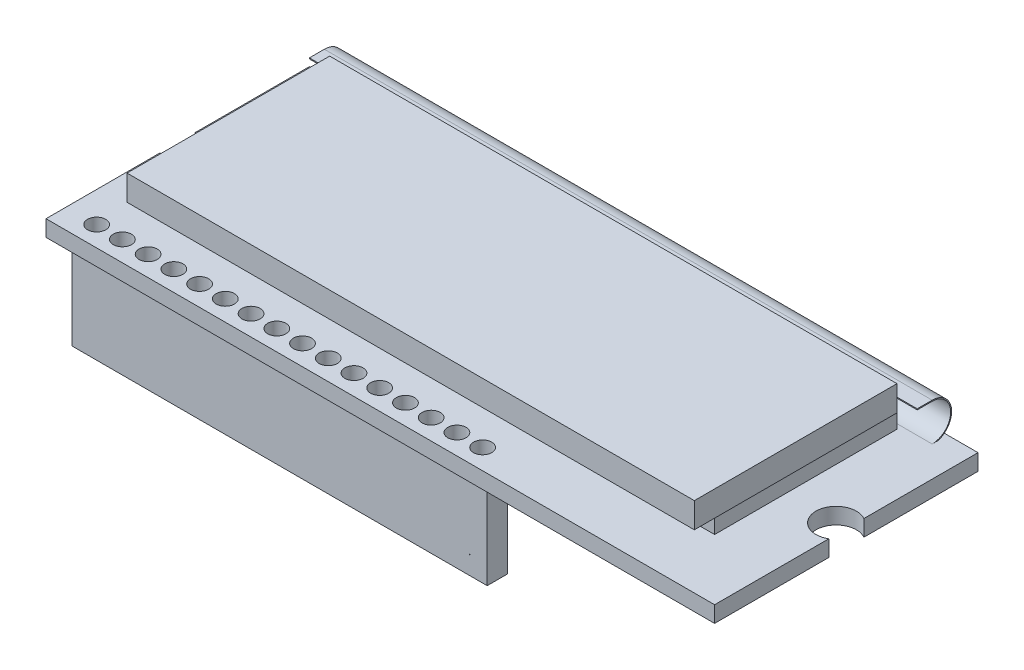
from build123d import *

# Parameters (mm, degrees)
SKETCH1_W                = 66
SKETCH1_H                = 26
BOSS_EXTRUDE1_DEPTH      = 1.6
SKETCH2_R                = 2
CUT_EXTRUDE1_DEPTH       = 36.504365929
SKETCH3_W                = 54
SKETCH3_H                = 18
BOSS_EXTRUDE2_DEPTH      = 2.4
SKETCH4_W                = 56
SKETCH4_H                = 20
BOSS_EXTRUDE3_DEPTH      = 2.5
EXTRUDE_THIN1_DEPTH      = 30
EXTRUDE_THIN1_DEPTH_BACK = 30
SKETCH6_R                = 0.9
CUT_EXTRUDE2_DEPTH       = 36.952329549
SKETCH7_W                = 41
SKETCH7_H                = 2
BOSS_EXTRUDE4_DEPTH      = 9
CUT_EXTRUDE3_START       = -9
SKETCH8_R                = 0.9
CUT_EXTRUDE3_DEPTH       = 9


with BuildPart() as part:
    # Sketch1 → Boss-Extrude1 (new body)
    with BuildSketch(Plane(origin=(0, 0, 0), x_dir=(1, 0, 0), z_dir=(0, 1, 0))):
        Rectangle(SKETCH1_W, SKETCH1_H)
    extrude(amount=BOSS_EXTRUDE1_DEPTH)

    # Sketch2 → Cut-Extrude1 (cut, through all)
    with BuildSketch(Plane(origin=(0, 1.6, 0), x_dir=(1, 0, 0), z_dir=(0, 1, 0))):
        with Locations((-32, 0)):
            Circle(SKETCH2_R)
        with Locations((32, 0)):
            Circle(SKETCH2_R)
    extrude(amount=-CUT_EXTRUDE1_DEPTH, mode=Mode.SUBTRACT)

    # Sketch3 → Boss-Extrude2 (add)
    with BuildSketch(Plane(origin=(0, 1.6, 0), x_dir=(1, 0, 0), z_dir=(0, 1, 0))):
        with Locations((0, 2)):
            Rectangle(SKETCH3_W, SKETCH3_H)
    extrude(amount=BOSS_EXTRUDE2_DEPTH)

    # Sketch4 → Boss-Extrude3 (add)
    with BuildSketch(Plane(origin=(0, 4, 0), x_dir=(1, 0, 0), z_dir=(0, 1, 0))):
        Rectangle(SKETCH4_W, SKETCH4_H)
    extrude(amount=BOSS_EXTRUDE3_DEPTH)

    # Sketch5 → Extrude-Thin1 (add, two sides: drawn at the far end of the back side and taken through both)
    with BuildSketch(Plane(origin=(0, 0, 0), x_dir=(0, 0, -1), z_dir=(1, 0, 0)).offset(-EXTRUDE_THIN1_DEPTH_BACK)):
        with BuildLine():
            Line((10, 5.25), (11.475, 5.25))
            ThreePointArc((11.475, 5.25), (13.3, 3.425), (11.475, 1.6))
            Line((11.475, 1.6), (11.475, 1.5))
            ThreePointArc((11.475, 1.5), (13.4, 3.425), (11.475, 5.35))
            Line((11.475, 5.35), (10, 5.35))
            Line((10, 5.35), (10, 5.25))
        make_face()
    extrude(amount=EXTRUDE_THIN1_DEPTH + EXTRUDE_THIN1_DEPTH_BACK)

    # Sketch6 → Cut-Extrude2 (cut, through all)
    with BuildSketch(Plane(origin=(0, 1.6, 0), x_dir=(1, 0, 0), z_dir=(0, 1, 0))):
        with Locations(Location((-30, -11, 0), (0, 0, 270))):
            Circle(SKETCH6_R)
        with Locations(Location((-27.46, -11, 0), (0, 0, 270))):
            Circle(SKETCH6_R)
        with Locations(Location((-24.92, -11, 0), (0, 0, 270))):
            Circle(SKETCH6_R)
        with Locations(Location((-22.38, -11, 0), (0, 0, 270))):
            Circle(SKETCH6_R)
        with Locations(Location((-19.84, -11, 0), (0, 0, 270))):
            Circle(SKETCH6_R)
        with Locations(Location((-17.3, -11, 0), (0, 0, 270))):
            Circle(SKETCH6_R)
        with Locations(Location((-14.76, -11, 0), (0, 0, 270))):
            Circle(SKETCH6_R)
        with Locations(Location((-12.22, -11, 0), (0, 0, 270))):
            Circle(SKETCH6_R)
        with Locations(Location((-9.68, -11, 0), (0, 0, 270))):
            Circle(SKETCH6_R)
        with Locations(Location((-7.14, -11, 0), (0, 0, 270))):
            Circle(SKETCH6_R)
        with Locations(Location((-4.6, -11, 0), (0, 0, 270))):
            Circle(SKETCH6_R)
        with Locations(Location((-2.06, -11, 0), (0, 0, 270))):
            Circle(SKETCH6_R)
        with Locations(Location((0.48, -11, 0), (0, 0, 270))):
            Circle(SKETCH6_R)
        with Locations(Location((3.02, -11, 0), (0, 0, 270))):
            Circle(SKETCH6_R)
        with Locations(Location((5.56, -11, 0), (0, 0, 270))):
            Circle(SKETCH6_R)
        with Locations(Location((8.1, -11, 0), (0, 0, 270))):
            Circle(SKETCH6_R)
    extrude(amount=-CUT_EXTRUDE2_DEPTH, mode=Mode.SUBTRACT)

    # Sketch7 → Boss-Extrude4 (add)
    with BuildSketch(Plane.XZ):
        with Locations((-10.95, 11)):
            Rectangle(SKETCH7_W, SKETCH7_H)
    extrude(amount=BOSS_EXTRUDE4_DEPTH)

    # Sketch8 → Cut-Extrude3 (cut)
    with BuildSketch(Plane.XZ.offset(9).offset(CUT_EXTRUDE3_START)):
        with Locations(Location((-19.84, 11, 0), (0, 0, 90))):
            Circle(SKETCH8_R)
        with Locations(Location((-22.38, 11, 0), (0, 0, 90))):
            Circle(SKETCH8_R)
        with Locations(Location((-24.92, 11, 0), (0, 0, 90))):
            Circle(SKETCH8_R)
        with Locations(Location((-27.46, 11, 0), (0, 0, 90))):
            Circle(SKETCH8_R)
        with Locations(Location((-30, 11, 0), (0, 0, 90))):
            Circle(SKETCH8_R)
        with Locations(Location((0.48, 11, 0), (0, 0, 90))):
            Circle(SKETCH8_R)
        with Locations(Location((-2.06, 11, 0), (0, 0, 90))):
            Circle(SKETCH8_R)
        with Locations(Location((-4.6, 11, 0), (0, 0, 90))):
            Circle(SKETCH8_R)
        with Locations(Location((-7.14, 11, 0), (0, 0, 90))):
            Circle(SKETCH8_R)
        with Locations(Location((-9.68, 11, 0), (0, 0, 90))):
            Circle(SKETCH8_R)
        with Locations(Location((-12.22, 11, 0), (0, 0, 90))):
            Circle(SKETCH8_R)
        with Locations(Location((-14.76, 11, 0), (0, 0, 90))):
            Circle(SKETCH8_R)
        with Locations(Location((-17.3, 11, 0), (0, 0, 90))):
            Circle(SKETCH8_R)
        with Locations(Location((8.1, 11, 0), (0, 0, 90))):
            Circle(SKETCH8_R)
        with Locations(Location((5.56, 11, 0), (0, 0, 90))):
            Circle(SKETCH8_R)
        with Locations(Location((3.02, 11, 0), (0, 0, 90))):
            Circle(SKETCH8_R)
    extrude(amount=CUT_EXTRUDE3_DEPTH, mode=Mode.SUBTRACT)


solid = part.part
